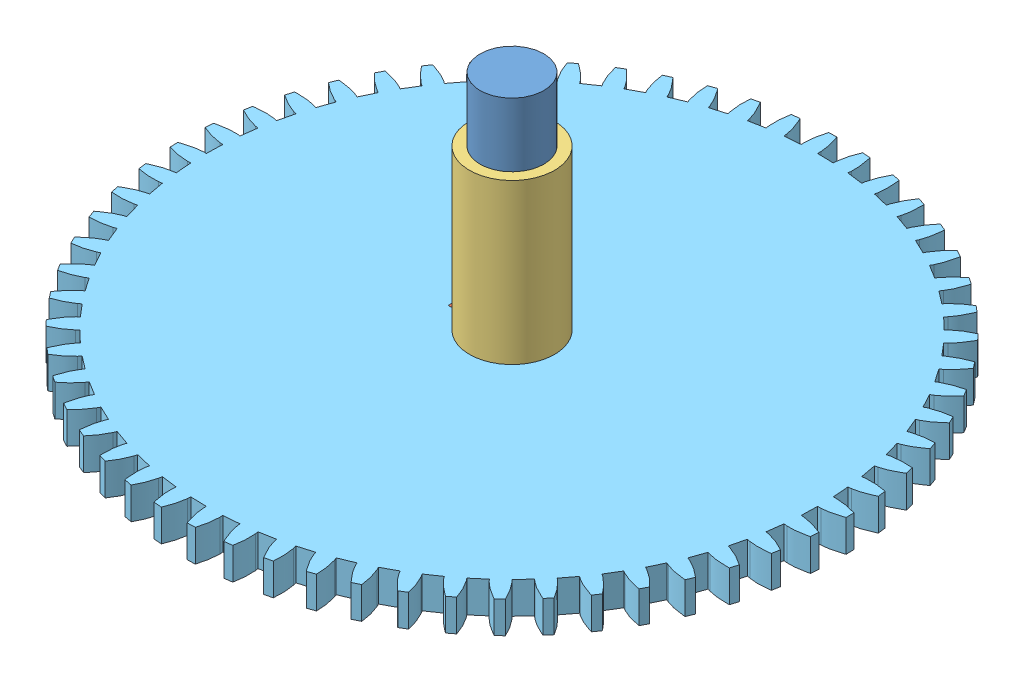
SolidWorks assembly Axle Assembly H.SLDASM, configuration Default (file format 6000). Lengths in mm.
Overall size (31 16.5 31).
6 component instances, 5 part files, 15 mates.
Components (placement in the parent):
- Axle H-1: Axle H.SLDPRT [Default] at (-36.6511 1.2425 10.571) size (3 16.5 3)
- Key-1: Key.SLDPRT [Default] at (-36.6511 7.2425 10.571) x (1 0 0) z (0 0 -1) size (2 1.5 1)
- Key-2: Key.SLDPRT [Default] at (-36.6511 4.2425 10.571) x (-1 0 0) z (0 0 -1) size (2 1.5 1)
- Spacer 7.5mm-1: Spacer 7.5mm.SLDPRT [Default] at (-35.1511 14.7425 10.571) x (0 0 1) z (1 0 0) size (4 7.5 4)
- Gear 15T-1: Gear 15T.sldprt [Default] at (-35.1511 5.7425 10.571) x (0 0 1) z (1 0 0) size (8.48 1.5 8.44)
- Gear 60T-1: Gear 60T.sldprt [Default] at (-35.1511 5.7425 10.571) x (0 0 -1) z (1 0 0) size (31 1.5 31)
Mates (geometry in assembly coordinates):
- Coincident1: coincident anti-aligned: plane of Key-1 through (-36.6511 5.7425 10.571) normal (0 -1 0); plane of Key-2 through (-36.6511 5.7425 10.571) normal (0 1 0)
- Coincident2: coincident aligned: plane of Key-1 through (-37.6511 5.7425 10.071) normal (0 0 -1); plane of Key-2 through (-35.6511 5.7425 10.071) normal (0 0 -1)
- Coincident3: coincident aligned: plane of Key-1 through (-35.6511 5.7425 10.071) normal (1 0 0); plane of Key-2 through (-35.6511 5.7425 10.071) normal (1 0 0)
- Coincident4: coincident anti-aligned: plane of Axle H-1 through (-35.6511 1.2425 10.571) normal (-1 0 0); plane of Key-2 through (-35.6511 5.7425 10.071) normal (1 0 0)
- Coincident5: coincident anti-aligned: plane of Axle H-1 through (-35.6511 4.2425 10.071) normal (0 0 1); plane of Key-1 through (-37.6511 5.7425 10.071) normal (0 0 -1)
- Coincident6: coincident anti-aligned: plane of Axle H-1 through (-35.6511 4.2425 10.071) normal (0 1 0); plane of Key-2 through (-36.6511 4.2425 10.571) normal (0 -1 0)
- Concentric3: concentric anti-aligned: cylinder of Axle H-1 through (-35.1511 17.7425 10.571) axis (0 -1 0) radius 1.5; cylinder of Spacer 7.5mm-1 through (-35.1511 7.2425 10.571) axis (0 1 0) radius 1.5
- Parallel2: parallel anti-aligned: line of Key-1 through (-35.6511 7.2425 11.071) axis (-1 0 0); line of Spacer 7.5mm-1 through (-35.1511 14.7425 10.571) axis (1 0 0)
- Coincident11: coincident anti-aligned: plane of Key-1 through (-36.6511 7.2425 10.571) normal (0 1 0); plane of Spacer 7.5mm-1 through (-35.1511 7.2425 10.571) normal (0 -1 0)
- Coincident12: coincident aligned: plane of Key-1 through (-36.6511 7.2425 10.571) normal (0 1 0); plane of Gear 60T-1 through (-29.7979 7.2425 31.3345) normal (0 1 0)
- Concentric4: concentric aligned: cylinder of Axle H-1 through (-35.1511 17.7425 10.571) axis (0 -1 0) radius 1.5; cylinder of Gear 60T-1 through (-35.1511 7.2425 10.571) axis (0 -1 0) radius 1.5
- Coincident13: coincident anti-aligned: line of Key-1 through (-37.6511 7.2425 11.071) axis (0 0 -1); line of Gear 60T-1 through (-37.6511 7.2425 10.071) axis (0 0 1)
- Coincident14: coincident aligned: plane of Key-2 through (-36.6511 4.2425 10.571) normal (0 -1 0); plane of Gear 15T-1 through (-34.0241 4.2425 5.6265) normal (0 -1 0)
- Concentric5: concentric anti-aligned: cylinder of Axle H-1 through (-35.1511 17.7425 10.571) axis (0 -1 0) radius 1.5; cylinder of Gear 15T-1 through (-35.1511 4.2425 10.571) axis (0 1 0) radius 1.5
- Parallel3: parallel anti-aligned: line of Key-2 through (-37.6511 4.2425 10.071) axis (0 0 1); line of Gear 15T-1 through (-37.6511 4.2425 11.071) axis (0 0 -1)
